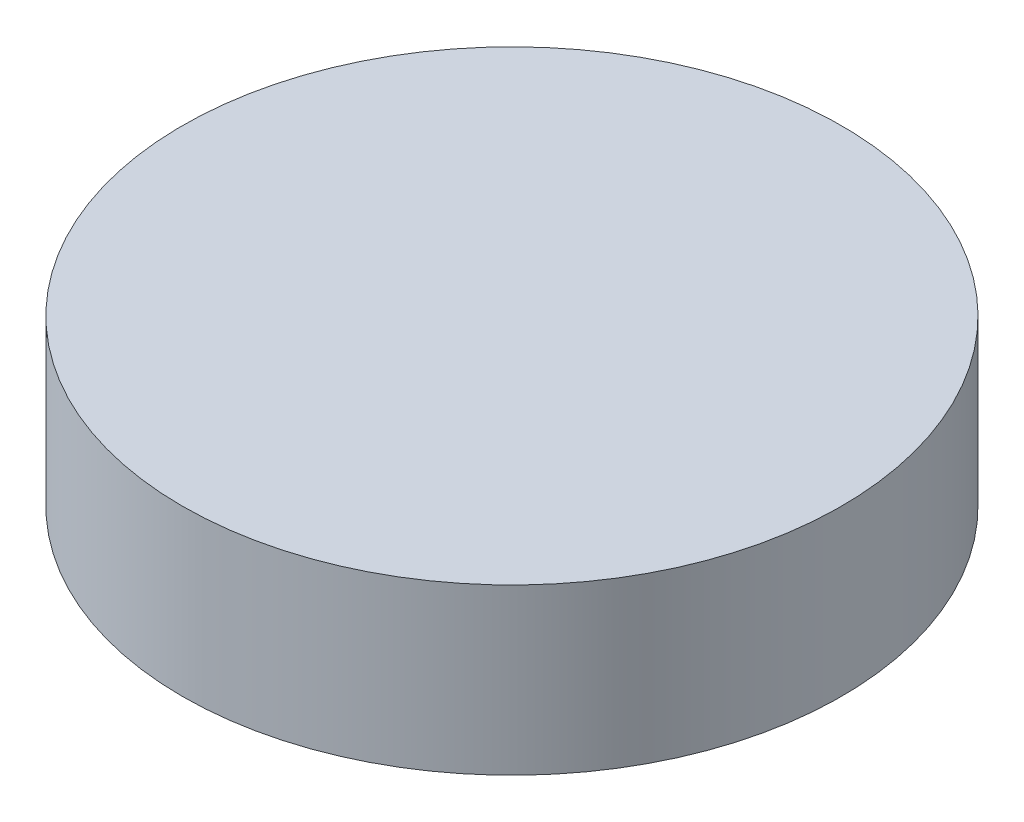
ISO-10303-21;
HEADER;
FILE_DESCRIPTION(('STEP AP214'),'2;1');
FILE_NAME('part.step','',(''),(''),'','','');
FILE_SCHEMA(('AUTOMOTIVE_DESIGN { 1 0 10303 214 1 1 1 1 }'));
ENDSEC;
DATA;
#1=APPLICATION_CONTEXT('core data for automotive mechanical design processes');
#2=APPLICATION_PROTOCOL_DEFINITION('international standard','automotive_design',2000,#1);
#3=PRODUCT_CONTEXT('',#1,'mechanical');
#4=PRODUCT('Part','Part','',(#3));
#5=PRODUCT_RELATED_PRODUCT_CATEGORY('part','',(#4));
#6=PRODUCT_DEFINITION_FORMATION('','',#4);
#7=PRODUCT_DEFINITION_CONTEXT('part definition',#1,'design');
#8=PRODUCT_DEFINITION('design','',#6,#7);
#9=PRODUCT_DEFINITION_SHAPE('','',#8);
#10=(LENGTH_UNIT() NAMED_UNIT(*) SI_UNIT(.MILLI.,.METRE.));
#11=(NAMED_UNIT(*) PLANE_ANGLE_UNIT() SI_UNIT($,.RADIAN.));
#12=(NAMED_UNIT(*) SI_UNIT($,.STERADIAN.) SOLID_ANGLE_UNIT());
#13=UNCERTAINTY_MEASURE_WITH_UNIT(LENGTH_MEASURE(1.E-05),#10,'distance_accuracy_value','');
#14=(GEOMETRIC_REPRESENTATION_CONTEXT(3) GLOBAL_UNCERTAINTY_ASSIGNED_CONTEXT((#13)) GLOBAL_UNIT_ASSIGNED_CONTEXT((#10,
#11,#12)) REPRESENTATION_CONTEXT('',''));
#15=CARTESIAN_POINT('',(0.,0.,0.));
#16=DIRECTION('',(0.,0.,1.));
#17=DIRECTION('',(1.,0.,0.));
#18=AXIS2_PLACEMENT_3D('',#15,#16,#17);
#19=CARTESIAN_POINT('',(-34.,1.17300199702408,1.11022302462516E-13));
#20=DIRECTION('',(0.,1.,0.));
#21=DIRECTION('',(0.,0.,1.));
#22=AXIS2_PLACEMENT_3D('',#19,#20,#21);
#23=CYLINDRICAL_SURFACE('',#22,6.);
#24=CARTESIAN_POINT('',(-34.0000000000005,-9.64425366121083,-1.11022302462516E-13));
#25=DIRECTION('',(0.,1.,0.));
#26=DIRECTION('',(0.,0.,1.));
#27=AXIS2_PLACEMENT_3D('',#24,#25,#26);
#28=CIRCLE('',#27,6.);
#29=CARTESIAN_POINT('',(-34.0000000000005,-9.64425366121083,5.99999999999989));
#30=VERTEX_POINT('',#29);
#31=EDGE_CURVE('E40',#30,#30,#28,.T.);
#32=ORIENTED_EDGE('',*,*,#31,.T.);
#33=EDGE_LOOP('',(#32));
#34=FACE_BOUND('',#33,.T.);
#35=CARTESIAN_POINT('',(-34.,-6.64425366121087,-2.22044604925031E-13));
#36=DIRECTION('',(0.,1.,0.));
#37=DIRECTION('',(0.,0.,1.));
#38=AXIS2_PLACEMENT_3D('',#35,#36,#37);
#39=CIRCLE('',#38,6.00000000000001);
#40=CARTESIAN_POINT('',(-34.,-6.64425366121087,5.99999999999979));
#41=VERTEX_POINT('',#40);
#42=EDGE_CURVE('E10',#41,#41,#39,.T.);
#43=ORIENTED_EDGE('',*,*,#42,.F.);
#44=EDGE_LOOP('',(#43));
#45=FACE_BOUND('',#44,.T.);
#46=ADVANCED_FACE('F30',(#34,#45),#23,.T.);
#47=CARTESIAN_POINT('',(-40.,-6.64425366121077,0.));
#48=DIRECTION('',(0.,1.,0.));
#49=DIRECTION('',(0.,0.,1.));
#50=AXIS2_PLACEMENT_3D('',#47,#48,#49);
#51=PLANE('',#50);
#52=ORIENTED_EDGE('',*,*,#42,.T.);
#53=EDGE_LOOP('',(#52));
#54=FACE_BOUND('',#53,.T.);
#55=ADVANCED_FACE('F56',(#54),#51,.T.);
#56=CARTESIAN_POINT('',(-34.0000000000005,-13.6442536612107,-1.11022302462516E-13));
#57=DIRECTION('',(0.,1.,0.));
#58=DIRECTION('',(-1.,0.,0.));
#59=AXIS2_PLACEMENT_3D('',#56,#57,#58);
#60=SPHERICAL_SURFACE('',#59,5.);
#61=CARTESIAN_POINT('',(-34.0000000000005,-9.64425366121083,-1.11022302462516E-13));
#62=DIRECTION('',(0.,1.,0.));
#63=DIRECTION('',(0.,0.,1.));
#64=AXIS2_PLACEMENT_3D('',#61,#62,#63);
#65=CIRCLE('',#64,3.);
#66=CARTESIAN_POINT('',(-34.0000000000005,-9.64425366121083,2.99999999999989));
#67=VERTEX_POINT('',#66);
#68=EDGE_CURVE('E36',#67,#67,#65,.T.);
#69=ORIENTED_EDGE('',*,*,#68,.F.);
#70=EDGE_LOOP('',(#69));
#71=FACE_BOUND('',#70,.T.);
#72=ADVANCED_FACE('F51',(#71),#60,.F.);
#73=CARTESIAN_POINT('',(-39.9999999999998,-9.64425366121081,-1.11022302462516E-13));
#74=DIRECTION('',(0.,-1.,0.));
#75=DIRECTION('',(0.,0.,-1.));
#76=AXIS2_PLACEMENT_3D('',#73,#74,#75);
#77=PLANE('',#76);
#78=ORIENTED_EDGE('',*,*,#68,.T.);
#79=EDGE_LOOP('',(#78));
#80=FACE_BOUND('',#79,.T.);
#81=ORIENTED_EDGE('',*,*,#31,.F.);
#82=EDGE_LOOP('',(#81));
#83=FACE_BOUND('',#82,.T.);
#84=ADVANCED_FACE('F49',(#80,#83),#77,.T.);
#85=CLOSED_SHELL('',(#46,#55,#72,#84));
#86=MANIFOLD_SOLID_BREP('B2',#85);
#87=ADVANCED_BREP_SHAPE_REPRESENTATION('',(#18,#86),#14);
#88=SHAPE_DEFINITION_REPRESENTATION(#9,#87);
ENDSEC;
END-ISO-10303-21;
